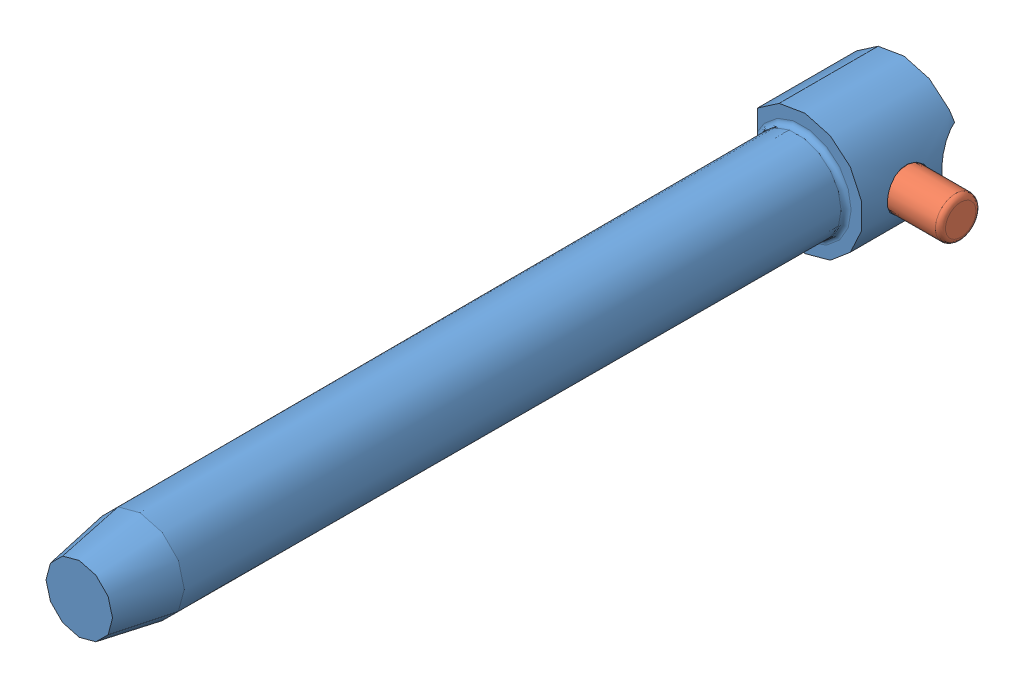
SolidWorks assembly barrel plunger.SLDASM, configuration По умолчанию (file format 6000). Lengths in mm.
Overall size (12.27 9.53 64.29).
2 component instances, 2 part files, 2 mates.
Components (placement in the parent):
- barrel plunger-1: barrel plunger.SLDPRT [По умолчанию] at origin size (8.24 9.53 64.29)
- barrel plunger pin-1: barrel plunger pin.SLDPRT [По умолчанию] at (-3.4798 0 0) x (0 0.567844 0.823136) z (-1 0 0) size (3.43 3.43 12.27)
Mates (geometry in assembly coordinates):
- Концентричный3: concentric: cylinder of barrel plunger-1 through (-4.441 0 0) axis (-1 0 0) radius 1.2573; cylinder of barrel plunger pin-1 through (-3.4798 0 0) axis (-1 0 0) radius 1.2573
- Совпадение2: coincident aligned: plane of barrel plunger-1 through (-3.4798 3.2515 60.179) normal (-1 0 0); plane of barrel plunger pin-1 through (-3.4798 0 0) normal (-1 0 0)
